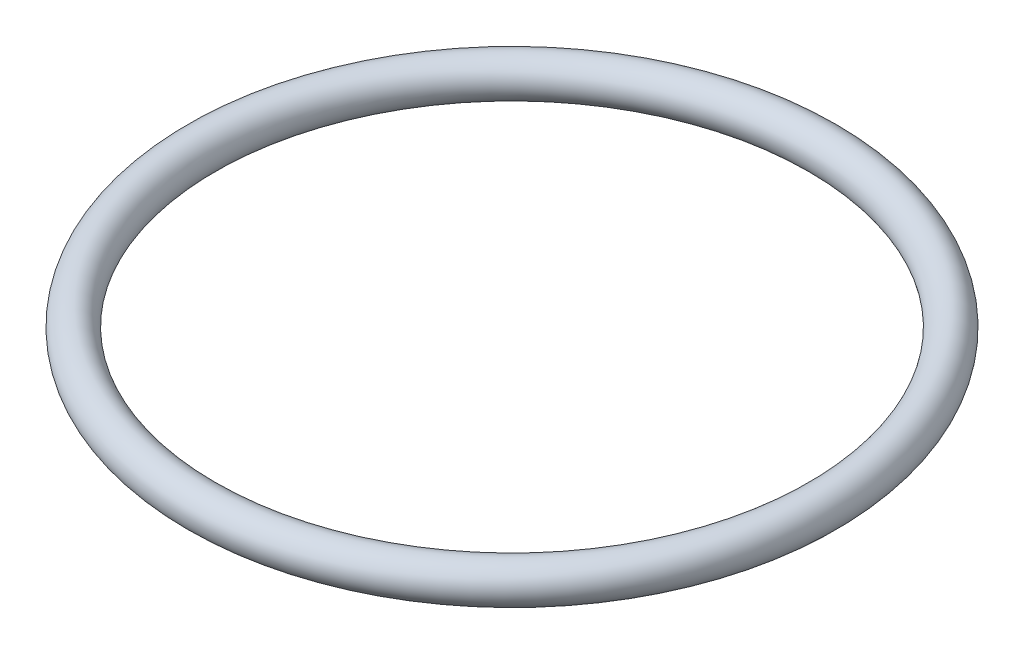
ISO-10303-21;
HEADER;
FILE_DESCRIPTION(('STEP AP214'),'2;1');
FILE_NAME('part.step','',(''),(''),'','','');
FILE_SCHEMA(('AUTOMOTIVE_DESIGN { 1 0 10303 214 1 1 1 1 }'));
ENDSEC;
DATA;
#1=APPLICATION_CONTEXT('core data for automotive mechanical design processes');
#2=APPLICATION_PROTOCOL_DEFINITION('international standard','automotive_design',2000,#1);
#3=PRODUCT_CONTEXT('',#1,'mechanical');
#4=PRODUCT('Part','Part','',(#3));
#5=PRODUCT_RELATED_PRODUCT_CATEGORY('part','',(#4));
#6=PRODUCT_DEFINITION_FORMATION('','',#4);
#7=PRODUCT_DEFINITION_CONTEXT('part definition',#1,'design');
#8=PRODUCT_DEFINITION('design','',#6,#7);
#9=PRODUCT_DEFINITION_SHAPE('','',#8);
#10=(LENGTH_UNIT() NAMED_UNIT(*) SI_UNIT(.MILLI.,.METRE.));
#11=(NAMED_UNIT(*) PLANE_ANGLE_UNIT() SI_UNIT($,.RADIAN.));
#12=(NAMED_UNIT(*) SI_UNIT($,.STERADIAN.) SOLID_ANGLE_UNIT());
#13=UNCERTAINTY_MEASURE_WITH_UNIT(LENGTH_MEASURE(1.E-05),#10,'distance_accuracy_value','');
#14=(GEOMETRIC_REPRESENTATION_CONTEXT(3) GLOBAL_UNCERTAINTY_ASSIGNED_CONTEXT((#13)) GLOBAL_UNIT_ASSIGNED_CONTEXT((#10,
#11,#12)) REPRESENTATION_CONTEXT('',''));
#15=CARTESIAN_POINT('',(0.,0.,0.));
#16=DIRECTION('',(0.,0.,1.));
#17=DIRECTION('',(1.,0.,0.));
#18=AXIS2_PLACEMENT_3D('',#15,#16,#17);
#19=CARTESIAN_POINT('',(0.,0.,0.));
#20=DIRECTION('',(0.,-1.,0.));
#21=DIRECTION('',(0.,0.,-1.));
#22=AXIS2_PLACEMENT_3D('',#19,#20,#21);
#23=TOROIDAL_SURFACE('',#22,14.2875,0.889000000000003);
#24=CARTESIAN_POINT('',(0.,0.,-15.1765));
#25=VERTEX_POINT('',#24);
#26=VERTEX_LOOP('',#25);
#27=FACE_BOUND('',#26,.T.);
#28=ADVANCED_FACE('F37',(#27),#23,.T.);
#29=CLOSED_SHELL('',(#28));
#30=MANIFOLD_SOLID_BREP('B2',#29);
#31=ADVANCED_BREP_SHAPE_REPRESENTATION('',(#18,#30),#14);
#32=SHAPE_DEFINITION_REPRESENTATION(#9,#31);
ENDSEC;
END-ISO-10303-21;
